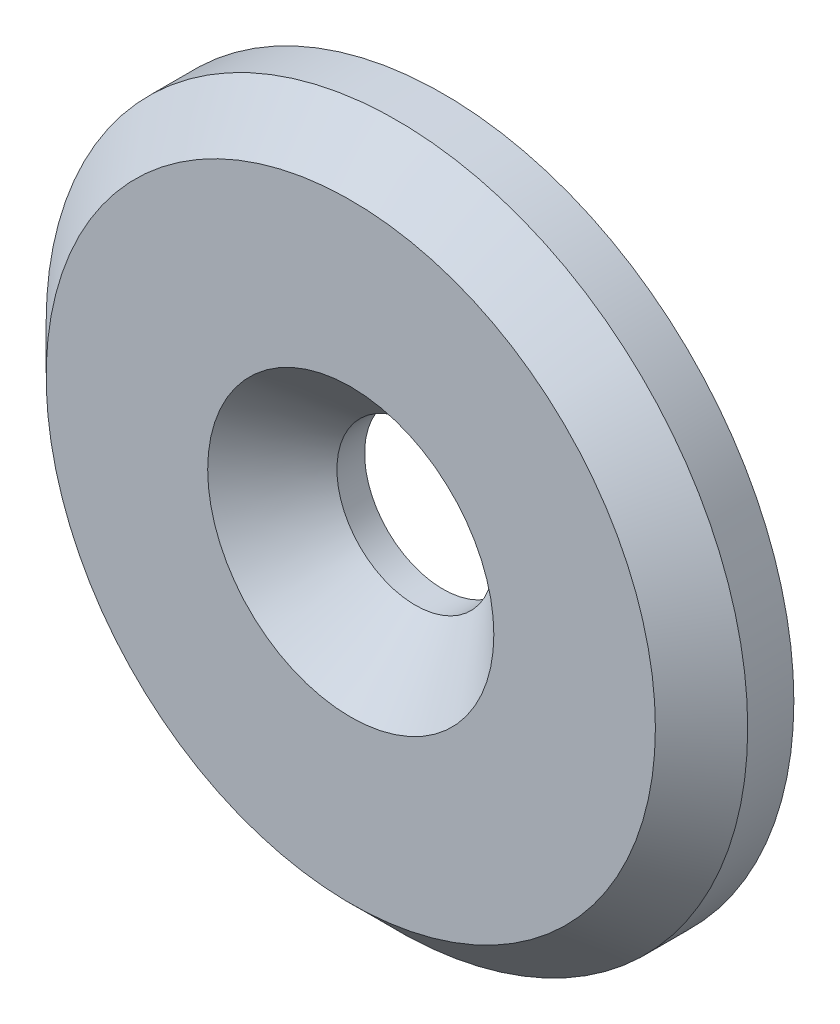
ISO-10303-21;
HEADER;
FILE_DESCRIPTION(('STEP AP214'),'2;1');
FILE_NAME('part.step','',(''),(''),'','','');
FILE_SCHEMA(('AUTOMOTIVE_DESIGN { 1 0 10303 214 1 1 1 1 }'));
ENDSEC;
DATA;
#1=APPLICATION_CONTEXT('core data for automotive mechanical design processes');
#2=APPLICATION_PROTOCOL_DEFINITION('international standard','automotive_design',2000,#1);
#3=PRODUCT_CONTEXT('',#1,'mechanical');
#4=PRODUCT('Part','Part','',(#3));
#5=PRODUCT_RELATED_PRODUCT_CATEGORY('part','',(#4));
#6=PRODUCT_DEFINITION_FORMATION('','',#4);
#7=PRODUCT_DEFINITION_CONTEXT('part definition',#1,'design');
#8=PRODUCT_DEFINITION('design','',#6,#7);
#9=PRODUCT_DEFINITION_SHAPE('','',#8);
#10=(LENGTH_UNIT() NAMED_UNIT(*) SI_UNIT(.MILLI.,.METRE.));
#11=(NAMED_UNIT(*) PLANE_ANGLE_UNIT() SI_UNIT($,.RADIAN.));
#12=(NAMED_UNIT(*) SI_UNIT($,.STERADIAN.) SOLID_ANGLE_UNIT());
#13=UNCERTAINTY_MEASURE_WITH_UNIT(LENGTH_MEASURE(1.E-05),#10,'distance_accuracy_value','');
#14=(GEOMETRIC_REPRESENTATION_CONTEXT(3) GLOBAL_UNCERTAINTY_ASSIGNED_CONTEXT((#13)) GLOBAL_UNIT_ASSIGNED_CONTEXT((#10,
#11,#12)) REPRESENTATION_CONTEXT('',''));
#15=CARTESIAN_POINT('',(0.,0.,0.));
#16=DIRECTION('',(0.,0.,1.));
#17=DIRECTION('',(1.,0.,0.));
#18=AXIS2_PLACEMENT_3D('',#15,#16,#17);
#19=CARTESIAN_POINT('',(0.,0.,5.));
#20=DIRECTION('',(0.,0.,1.));
#21=DIRECTION('',(1.,0.,0.));
#22=AXIS2_PLACEMENT_3D('',#19,#20,#21);
#23=PLANE('',#22);
#24=CARTESIAN_POINT('',(0.,0.,5.));
#25=DIRECTION('',(0.,0.,1.));
#26=DIRECTION('',(1.,0.,0.));
#27=AXIS2_PLACEMENT_3D('',#24,#25,#26);
#28=CIRCLE('',#27,7.75000000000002);
#29=CARTESIAN_POINT('',(7.75000000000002,0.,5.));
#30=VERTEX_POINT('',#29);
#31=EDGE_CURVE('E10',#30,#30,#28,.F.);
#32=ORIENTED_EDGE('',*,*,#31,.T.);
#33=EDGE_LOOP('',(#32));
#34=FACE_BOUND('',#33,.T.);
#35=CARTESIAN_POINT('',(0.,0.,5.));
#36=DIRECTION('',(0.,0.,1.));
#37=DIRECTION('',(1.,0.,0.));
#38=AXIS2_PLACEMENT_3D('',#35,#36,#37);
#39=CIRCLE('',#38,16.5);
#40=CARTESIAN_POINT('',(16.5,0.,5.));
#41=VERTEX_POINT('',#40);
#42=EDGE_CURVE('E41',#41,#41,#39,.T.);
#43=ORIENTED_EDGE('',*,*,#42,.T.);
#44=EDGE_LOOP('',(#43));
#45=FACE_BOUND('',#44,.T.);
#46=ADVANCED_FACE('F26',(#34,#45),#23,.T.);
#47=CARTESIAN_POINT('',(0.,0.,0.));
#48=DIRECTION('',(0.,0.,1.));
#49=DIRECTION('',(1.,0.,0.));
#50=AXIS2_PLACEMENT_3D('',#47,#48,#49);
#51=PLANE('',#50);
#52=CARTESIAN_POINT('',(0.,0.,0.));
#53=DIRECTION('',(0.,0.,1.));
#54=DIRECTION('',(1.,0.,0.));
#55=AXIS2_PLACEMENT_3D('',#52,#53,#54);
#56=CIRCLE('',#55,19.);
#57=CARTESIAN_POINT('',(19.,0.,0.));
#58=VERTEX_POINT('',#57);
#59=EDGE_CURVE('E46',#58,#58,#56,.T.);
#60=ORIENTED_EDGE('',*,*,#59,.F.);
#61=EDGE_LOOP('',(#60));
#62=FACE_BOUND('',#61,.T.);
#63=CARTESIAN_POINT('',(0.,0.,0.));
#64=DIRECTION('',(0.,0.,1.));
#65=DIRECTION('',(1.,0.,0.));
#66=AXIS2_PLACEMENT_3D('',#63,#64,#65);
#67=CIRCLE('',#66,4.25);
#68=CARTESIAN_POINT('',(4.25,0.,0.));
#69=VERTEX_POINT('',#68);
#70=EDGE_CURVE('E49',#69,#69,#67,.T.);
#71=ORIENTED_EDGE('',*,*,#70,.T.);
#72=EDGE_LOOP('',(#71));
#73=FACE_BOUND('',#72,.T.);
#74=ADVANCED_FACE('F53',(#62,#73),#51,.F.);
#75=CARTESIAN_POINT('',(0.,0.,5.));
#76=DIRECTION('',(0.,0.,-1.));
#77=DIRECTION('',(-1.,0.,0.));
#78=AXIS2_PLACEMENT_3D('',#75,#76,#77);
#79=CYLINDRICAL_SURFACE('',#78,19.);
#80=CARTESIAN_POINT('',(0.,0.,2.49999999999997));
#81=DIRECTION('',(0.,0.,1.));
#82=DIRECTION('',(1.,0.,0.));
#83=AXIS2_PLACEMENT_3D('',#80,#81,#82);
#84=CIRCLE('',#83,19.);
#85=CARTESIAN_POINT('',(19.,0.,2.49999999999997));
#86=VERTEX_POINT('',#85);
#87=EDGE_CURVE('E37',#86,#86,#84,.F.);
#88=ORIENTED_EDGE('',*,*,#87,.T.);
#89=EDGE_LOOP('',(#88));
#90=FACE_BOUND('',#89,.T.);
#91=ORIENTED_EDGE('',*,*,#59,.T.);
#92=EDGE_LOOP('',(#91));
#93=FACE_BOUND('',#92,.T.);
#94=ADVANCED_FACE('F28',(#90,#93),#79,.T.);
#95=CARTESIAN_POINT('',(0.,0.,5.));
#96=DIRECTION('',(0.,0.,-1.));
#97=DIRECTION('',(-1.,0.,0.));
#98=AXIS2_PLACEMENT_3D('',#95,#96,#97);
#99=CYLINDRICAL_SURFACE('',#98,4.25);
#100=CARTESIAN_POINT('',(0.,0.,1.49999999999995));
#101=DIRECTION('',(0.,0.,1.));
#102=DIRECTION('',(1.,0.,0.));
#103=AXIS2_PLACEMENT_3D('',#100,#101,#102);
#104=CIRCLE('',#103,4.25);
#105=CARTESIAN_POINT('',(4.25,0.,1.49999999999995));
#106=VERTEX_POINT('',#105);
#107=EDGE_CURVE('E33',#106,#106,#104,.T.);
#108=ORIENTED_EDGE('',*,*,#107,.T.);
#109=EDGE_LOOP('',(#108));
#110=FACE_BOUND('',#109,.T.);
#111=ORIENTED_EDGE('',*,*,#70,.F.);
#112=EDGE_LOOP('',(#111));
#113=FACE_BOUND('',#112,.T.);
#114=ADVANCED_FACE('F55',(#110,#113),#99,.F.);
#115=CARTESIAN_POINT('',(0.,0.,5.));
#116=DIRECTION('',(0.,0.,-1.));
#117=DIRECTION('',(-1.,0.,0.));
#118=AXIS2_PLACEMENT_3D('',#115,#116,#117);
#119=CONICAL_SURFACE('',#118,16.5,0.785398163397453);
#120=ORIENTED_EDGE('',*,*,#87,.F.);
#121=EDGE_LOOP('',(#120));
#122=FACE_BOUND('',#121,.T.);
#123=ORIENTED_EDGE('',*,*,#42,.F.);
#124=EDGE_LOOP('',(#123));
#125=FACE_BOUND('',#124,.T.);
#126=ADVANCED_FACE('F57',(#122,#125),#119,.T.);
#127=CARTESIAN_POINT('',(0.,0.,1.49999999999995));
#128=DIRECTION('',(0.,0.,1.));
#129=DIRECTION('',(1.,0.,0.));
#130=AXIS2_PLACEMENT_3D('',#127,#128,#129);
#131=CONICAL_SURFACE('',#130,4.25,0.785398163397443);
#132=CARTESIAN_POINT('',(7.75000000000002,0.,5.));
#133=CARTESIAN_POINT('',(7.71354166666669,0.,4.96354166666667));
#134=CARTESIAN_POINT('',(7.67708333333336,0.,4.92708333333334));
#135=CARTESIAN_POINT('',(7.60416666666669,0.,4.85416666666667));
#136=CARTESIAN_POINT('',(7.56770833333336,0.,4.81770833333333));
#137=CARTESIAN_POINT('',(7.49479166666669,0.,4.74479166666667));
#138=CARTESIAN_POINT('',(7.45833333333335,0.,4.70833333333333));
#139=CARTESIAN_POINT('',(7.38541666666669,0.,4.63541666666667));
#140=CARTESIAN_POINT('',(7.34895833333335,0.,4.59895833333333));
#141=CARTESIAN_POINT('',(7.27604166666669,0.,4.52604166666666));
#142=CARTESIAN_POINT('',(7.23958333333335,0.,4.48958333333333));
#143=CARTESIAN_POINT('',(7.16666666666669,0.,4.41666666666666));
#144=CARTESIAN_POINT('',(7.13020833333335,0.,4.38020833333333));
#145=CARTESIAN_POINT('',(7.05729166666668,0.,4.30729166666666));
#146=CARTESIAN_POINT('',(7.02083333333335,0.,4.27083333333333));
#147=CARTESIAN_POINT('',(6.94791666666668,0.,4.19791666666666));
#148=CARTESIAN_POINT('',(6.91145833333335,0.,4.16145833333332));
#149=CARTESIAN_POINT('',(6.83854166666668,0.,4.08854166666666));
#150=CARTESIAN_POINT('',(6.80208333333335,0.,4.05208333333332));
#151=CARTESIAN_POINT('',(6.72916666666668,0.,3.97916666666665));
#152=CARTESIAN_POINT('',(6.69270833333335,0.,3.94270833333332));
#153=CARTESIAN_POINT('',(6.61979166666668,0.,3.86979166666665));
#154=CARTESIAN_POINT('',(6.58333333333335,0.,3.83333333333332));
#155=CARTESIAN_POINT('',(6.51041666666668,0.,3.76041666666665));
#156=CARTESIAN_POINT('',(6.47395833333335,0.,3.72395833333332));
#157=CARTESIAN_POINT('',(6.40104166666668,0.,3.65104166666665));
#158=CARTESIAN_POINT('',(6.36458333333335,0.,3.61458333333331));
#159=CARTESIAN_POINT('',(6.29166666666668,0.,3.54166666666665));
#160=CARTESIAN_POINT('',(6.25520833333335,0.,3.50520833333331));
#161=CARTESIAN_POINT('',(6.18229166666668,0.,3.43229166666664));
#162=CARTESIAN_POINT('',(6.14583333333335,0.,3.39583333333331));
#163=CARTESIAN_POINT('',(6.07291666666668,0.,3.32291666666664));
#164=CARTESIAN_POINT('',(6.03645833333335,0.,3.28645833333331));
#165=CARTESIAN_POINT('',(5.96354166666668,0.,3.21354166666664));
#166=CARTESIAN_POINT('',(5.92708333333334,0.,3.17708333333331));
#167=CARTESIAN_POINT('',(5.85416666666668,0.,3.10416666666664));
#168=CARTESIAN_POINT('',(5.81770833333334,0.,3.06770833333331));
#169=CARTESIAN_POINT('',(5.74479166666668,0.,2.99479166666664));
#170=CARTESIAN_POINT('',(5.70833333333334,0.,2.9583333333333));
#171=CARTESIAN_POINT('',(5.63541666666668,0.,2.88541666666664));
#172=CARTESIAN_POINT('',(5.59895833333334,0.,2.8489583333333));
#173=CARTESIAN_POINT('',(5.52604166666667,0.,2.77604166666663));
#174=CARTESIAN_POINT('',(5.48958333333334,0.,2.7395833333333));
#175=CARTESIAN_POINT('',(5.41666666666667,0.,2.66666666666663));
#176=CARTESIAN_POINT('',(5.38020833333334,0.,2.6302083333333));
#177=CARTESIAN_POINT('',(5.30729166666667,0.,2.55729166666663));
#178=CARTESIAN_POINT('',(5.27083333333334,0.,2.5208333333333));
#179=CARTESIAN_POINT('',(5.19791666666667,0.,2.44791666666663));
#180=CARTESIAN_POINT('',(5.16145833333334,0.,2.41145833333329));
#181=CARTESIAN_POINT('',(5.08854166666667,0.,2.33854166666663));
#182=CARTESIAN_POINT('',(5.05208333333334,0.,2.30208333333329));
#183=CARTESIAN_POINT('',(4.97916666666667,0.,2.22916666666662));
#184=CARTESIAN_POINT('',(4.94270833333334,0.,2.19270833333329));
#185=CARTESIAN_POINT('',(4.86979166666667,0.,2.11979166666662));
#186=CARTESIAN_POINT('',(4.83333333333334,0.,2.08333333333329));
#187=CARTESIAN_POINT('',(4.76041666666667,0.,2.01041666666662));
#188=CARTESIAN_POINT('',(4.72395833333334,0.,1.97395833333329));
#189=CARTESIAN_POINT('',(4.65104166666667,0.,1.90104166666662));
#190=CARTESIAN_POINT('',(4.61458333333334,0.,1.86458333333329));
#191=CARTESIAN_POINT('',(4.54166666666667,0.,1.79166666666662));
#192=CARTESIAN_POINT('',(4.50520833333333,0.,1.75520833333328));
#193=CARTESIAN_POINT('',(4.43229166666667,0.,1.68229166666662));
#194=CARTESIAN_POINT('',(4.39583333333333,0.,1.64583333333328));
#195=CARTESIAN_POINT('',(4.32291666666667,0.,1.57291666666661));
#196=CARTESIAN_POINT('',(4.28645833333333,0.,1.53645833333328));
#197=CARTESIAN_POINT('',(4.25,0.,1.49999999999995));
#198=B_SPLINE_CURVE_WITH_KNOTS('',3,(#132,#133,#134,#135,#136,#137,#138,#139,#140,#141,#142,
#143,#144,#145,#146,#147,#148,#149,#150,#151,#152,#153,#154,#155,#156,#157,#158,#159,#160,#161,
#162,#163,#164,#165,#166,#167,#168,#169,#170,#171,#172,#173,#174,#175,#176,#177,#178,#179,#180,
#181,#182,#183,#184,#185,#186,#187,#188,#189,#190,#191,#192,#193,#194,#195,#196,#197),
.UNSPECIFIED.,.F.,.F.,(4,2,2,2,2,2,2,2,2,2,2,2,2,2,2,2,2,2,2,2,2,2,2,2,2,2,2,2,2,2,2,2,4),(0.,
0.154679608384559,0.309359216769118,0.464038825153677,0.618718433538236,0.773398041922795,
0.928077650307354,1.08275725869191,1.23743686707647,1.39211647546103,1.54679608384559,
1.70147569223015,1.85615530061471,2.01083490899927,2.16551451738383,2.32019412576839,
2.47487373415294,2.6295533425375,2.78423295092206,2.93891255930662,3.09359216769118,
3.24827177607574,3.4029513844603,3.55763099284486,3.71231060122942,3.86699020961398,
4.02166981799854,4.1763494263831,4.33102903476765,4.48570864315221,4.64038825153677,
4.79506785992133,4.94974746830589),.UNSPECIFIED.);
#199=EDGE_CURVE('BSEAM63',#30,#106,#198,.T.);
#200=ORIENTED_EDGE('',*,*,#31,.F.);
#201=ORIENTED_EDGE('',*,*,#107,.F.);
#202=ORIENTED_EDGE('',*,*,#199,.T.);
#203=ORIENTED_EDGE('',*,*,#199,.F.);
#204=EDGE_LOOP('',(#200,#202,#201,#203));
#205=FACE_BOUND('',#204,.T.);
#206=ADVANCED_FACE('F63',(#205),#131,.F.);
#207=CLOSED_SHELL('',(#46,#74,#94,#114,#126,#206));
#208=MANIFOLD_SOLID_BREP('B2',#207);
#209=ADVANCED_BREP_SHAPE_REPRESENTATION('',(#18,#208),#14);
#210=SHAPE_DEFINITION_REPRESENTATION(#9,#209);
ENDSEC;
END-ISO-10303-21;
